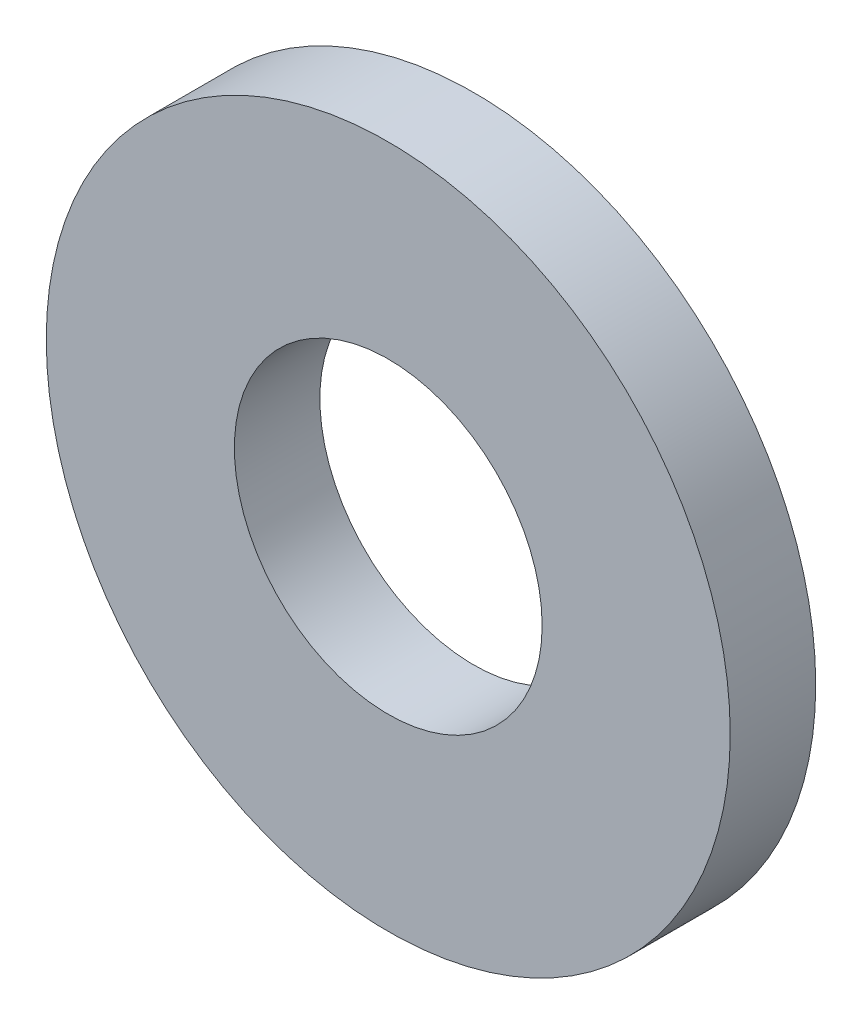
ISO-10303-21;
HEADER;
FILE_DESCRIPTION(('STEP AP214'),'2;1');
FILE_NAME('part.step','',(''),(''),'','','');
FILE_SCHEMA(('AUTOMOTIVE_DESIGN { 1 0 10303 214 1 1 1 1 }'));
ENDSEC;
DATA;
#1=APPLICATION_CONTEXT('core data for automotive mechanical design processes');
#2=APPLICATION_PROTOCOL_DEFINITION('international standard','automotive_design',2000,#1);
#3=PRODUCT_CONTEXT('',#1,'mechanical');
#4=PRODUCT('Part','Part','',(#3));
#5=PRODUCT_RELATED_PRODUCT_CATEGORY('part','',(#4));
#6=PRODUCT_DEFINITION_FORMATION('','',#4);
#7=PRODUCT_DEFINITION_CONTEXT('part definition',#1,'design');
#8=PRODUCT_DEFINITION('design','',#6,#7);
#9=PRODUCT_DEFINITION_SHAPE('','',#8);
#10=(LENGTH_UNIT() NAMED_UNIT(*) SI_UNIT(.MILLI.,.METRE.));
#11=(NAMED_UNIT(*) PLANE_ANGLE_UNIT() SI_UNIT($,.RADIAN.));
#12=(NAMED_UNIT(*) SI_UNIT($,.STERADIAN.) SOLID_ANGLE_UNIT());
#13=UNCERTAINTY_MEASURE_WITH_UNIT(LENGTH_MEASURE(1.E-05),#10,'distance_accuracy_value','');
#14=(GEOMETRIC_REPRESENTATION_CONTEXT(3) GLOBAL_UNCERTAINTY_ASSIGNED_CONTEXT((#13)) GLOBAL_UNIT_ASSIGNED_CONTEXT((#10,
#11,#12)) REPRESENTATION_CONTEXT('',''));
#15=CARTESIAN_POINT('',(0.,0.,0.));
#16=DIRECTION('',(0.,0.,1.));
#17=DIRECTION('',(1.,0.,0.));
#18=AXIS2_PLACEMENT_3D('',#15,#16,#17);
#19=CARTESIAN_POINT('',(0.,0.,2.5));
#20=DIRECTION('',(0.,0.,1.));
#21=DIRECTION('',(1.,0.,0.));
#22=AXIS2_PLACEMENT_3D('',#19,#20,#21);
#23=PLANE('',#22);
#24=CARTESIAN_POINT('',(0.,0.,2.5));
#25=DIRECTION('',(0.,0.,1.));
#26=DIRECTION('',(1.,0.,0.));
#27=AXIS2_PLACEMENT_3D('',#24,#25,#26);
#28=CIRCLE('',#27,10.);
#29=CARTESIAN_POINT('',(10.,0.,2.5));
#30=VERTEX_POINT('',#29);
#31=EDGE_CURVE('E10',#30,#30,#28,.T.);
#32=ORIENTED_EDGE('',*,*,#31,.T.);
#33=EDGE_LOOP('',(#32));
#34=FACE_BOUND('',#33,.T.);
#35=CARTESIAN_POINT('',(0.,0.,2.5));
#36=DIRECTION('',(0.,0.,1.));
#37=DIRECTION('',(1.,0.,0.));
#38=AXIS2_PLACEMENT_3D('',#35,#36,#37);
#39=CIRCLE('',#38,4.5);
#40=CARTESIAN_POINT('',(4.5,0.,2.5));
#41=VERTEX_POINT('',#40);
#42=EDGE_CURVE('E33',#41,#41,#39,.T.);
#43=ORIENTED_EDGE('',*,*,#42,.F.);
#44=EDGE_LOOP('',(#43));
#45=FACE_BOUND('',#44,.T.);
#46=ADVANCED_FACE('F22',(#34,#45),#23,.T.);
#47=CARTESIAN_POINT('',(0.,0.,0.));
#48=DIRECTION('',(0.,0.,1.));
#49=DIRECTION('',(1.,0.,0.));
#50=AXIS2_PLACEMENT_3D('',#47,#48,#49);
#51=PLANE('',#50);
#52=CARTESIAN_POINT('',(0.,0.,0.));
#53=DIRECTION('',(0.,0.,1.));
#54=DIRECTION('',(1.,0.,0.));
#55=AXIS2_PLACEMENT_3D('',#52,#53,#54);
#56=CIRCLE('',#55,10.);
#57=CARTESIAN_POINT('',(10.,0.,0.));
#58=VERTEX_POINT('',#57);
#59=EDGE_CURVE('E29',#58,#58,#56,.T.);
#60=ORIENTED_EDGE('',*,*,#59,.F.);
#61=EDGE_LOOP('',(#60));
#62=FACE_BOUND('',#61,.T.);
#63=CARTESIAN_POINT('',(0.,0.,0.));
#64=DIRECTION('',(0.,0.,1.));
#65=DIRECTION('',(1.,0.,0.));
#66=AXIS2_PLACEMENT_3D('',#63,#64,#65);
#67=CIRCLE('',#66,4.5);
#68=CARTESIAN_POINT('',(4.5,0.,0.));
#69=VERTEX_POINT('',#68);
#70=EDGE_CURVE('E37',#69,#69,#67,.T.);
#71=ORIENTED_EDGE('',*,*,#70,.T.);
#72=EDGE_LOOP('',(#71));
#73=FACE_BOUND('',#72,.T.);
#74=ADVANCED_FACE('F43',(#62,#73),#51,.F.);
#75=CARTESIAN_POINT('',(0.,0.,2.5));
#76=DIRECTION('',(0.,0.,-1.));
#77=DIRECTION('',(-1.,0.,0.));
#78=AXIS2_PLACEMENT_3D('',#75,#76,#77);
#79=CYLINDRICAL_SURFACE('',#78,10.);
#80=ORIENTED_EDGE('',*,*,#31,.F.);
#81=EDGE_LOOP('',(#80));
#82=FACE_BOUND('',#81,.T.);
#83=ORIENTED_EDGE('',*,*,#59,.T.);
#84=EDGE_LOOP('',(#83));
#85=FACE_BOUND('',#84,.T.);
#86=ADVANCED_FACE('F24',(#82,#85),#79,.T.);
#87=CARTESIAN_POINT('',(0.,0.,2.5));
#88=DIRECTION('',(0.,0.,-1.));
#89=DIRECTION('',(-1.,0.,0.));
#90=AXIS2_PLACEMENT_3D('',#87,#88,#89);
#91=CYLINDRICAL_SURFACE('',#90,4.5);
#92=ORIENTED_EDGE('',*,*,#42,.T.);
#93=EDGE_LOOP('',(#92));
#94=FACE_BOUND('',#93,.T.);
#95=ORIENTED_EDGE('',*,*,#70,.F.);
#96=EDGE_LOOP('',(#95));
#97=FACE_BOUND('',#96,.T.);
#98=ADVANCED_FACE('F45',(#94,#97),#91,.F.);
#99=CLOSED_SHELL('',(#46,#74,#86,#98));
#100=MANIFOLD_SOLID_BREP('B2',#99);
#101=ADVANCED_BREP_SHAPE_REPRESENTATION('',(#18,#100),#14);
#102=SHAPE_DEFINITION_REPRESENTATION(#9,#101);
ENDSEC;
END-ISO-10303-21;
